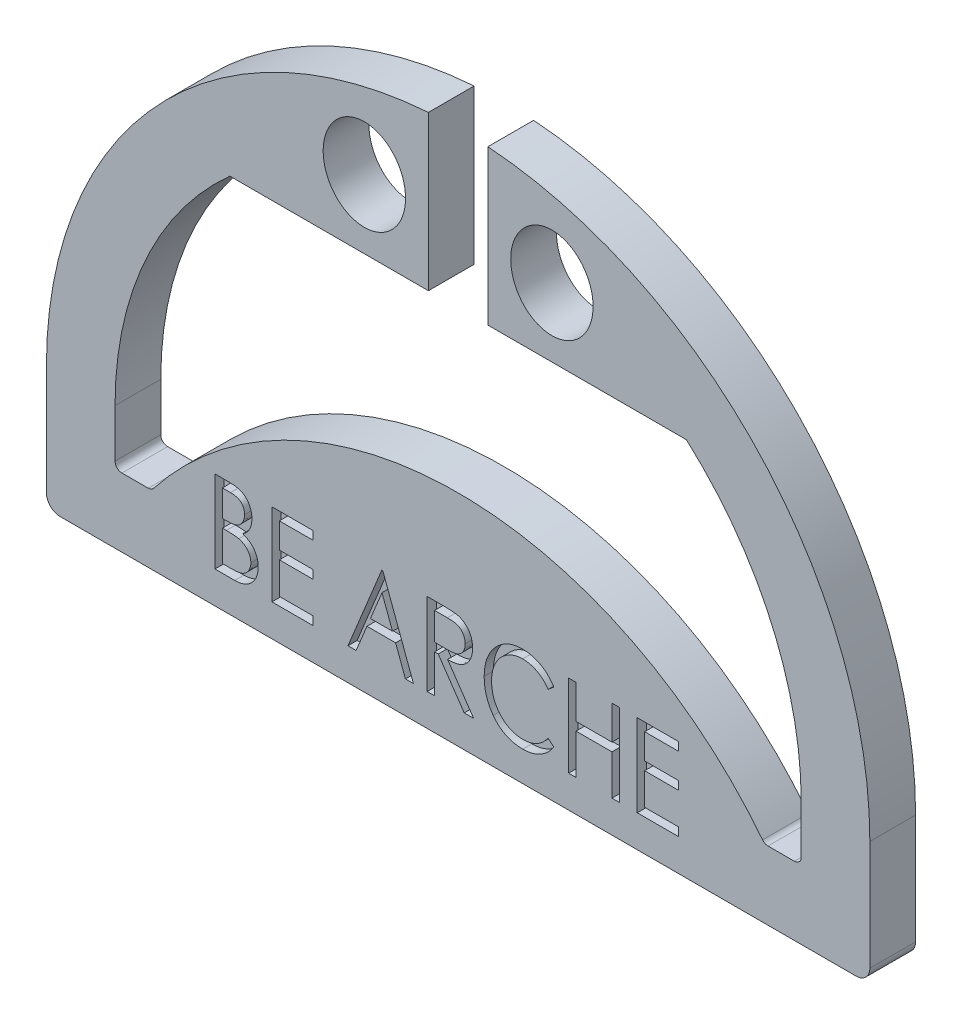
from build123d import *

# Parameters (mm, degrees)
ESQUISSE1_RX            = 10
ESQUISSE1_RY            = 9
EXTRUSION1_DEPTH        = 10
ENL_V_MAT_EXTRU_1_DEPTH = 2


with BuildPart() as part:
    # Esquisse1 → Extrusion1 (new body)
    with BuildSketch(Plane.XY):
        with BuildLine():
            Line((67.734776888, -12), (73.5, -12))
            ThreePointArc((73.5, -12), (74.560660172, -11.560660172), (75, -10.5))
            Line((75, -10.5), (75, 0))
            ThreePointArc((75, 0), (68.435155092, 30.685982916), (49.889878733, 56))
            Line((49.889878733, 56), (6.5, 56))
            Line((6.5, 56), (6.5, 89.764970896))
            ThreePointArc((6.5, 89.764970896), (65.897647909, 61.298450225), (90, 0))
            Line((90, 0), (90, -24))
            ThreePointArc((90, -24), (89.121320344, -26.121320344), (87, -27))
            Line((87, -27), (-87, -27))
            ThreePointArc((-87, -27), (-89.121320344, -26.121320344), (-90, -24))
            Line((-90, -24), (-90, 0))
            ThreePointArc((-90, 0), (-65.897647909, 61.298450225), (-6.5, 89.764970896))
            Line((-6.5, 89.764970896), (-6.5, 56))
            Line((-6.5, 56), (-49.889878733, 56))
            ThreePointArc((-49.889878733, 56), (-68.435155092, 30.685982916), (-75, 0))
            Line((-75, 0), (-75, -10.5))
            ThreePointArc((-75, -10.5), (-74.560660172, -11.560660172), (-73.5, -12))
            Line((-73.5, -12), (-67.734776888, -12))
            ThreePointArc((-67.734776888, -12), (-67.077806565, -11.848476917), (-66.553564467, -11.424519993))
            ThreePointArc((-66.553564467, -11.424519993), (0, 21), (66.553564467, -11.424519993))
            ThreePointArc((66.553564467, -11.424519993), (67.077806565, -11.848476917), (67.734776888, -12))
        make_face()
        with Locations(Location((20.5, 71), (0, 0, 90))):
            Ellipse(ESQUISSE1_RX, ESQUISSE1_RY, mode=Mode.SUBTRACT)
        with Locations(Location((-20.5, 71), (0, 0, 90))):
            Ellipse(ESQUISSE1_RX, ESQUISSE1_RY, mode=Mode.SUBTRACT)
    extrude(amount=EXTRUSION1_DEPTH)

    # Esquisse2 → Enl_v. mat.-Extru.1 (cut)
    # profile 1 of 7: a face of its own
    with BuildSketch(Plane.XY.offset(10)):
        with BuildLine():
            Line((-53.153846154, -2), (-50.081730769, -2))
            add(Edge.make_bspline(
                [(-50.081730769, -2), (-49.931443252, -2.000935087), (-49.639053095, -2.002754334), (-49.214545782, -2.029659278), (-48.817101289, -2.06692172), (-48.447847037, -2.125602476), (-48.104742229, -2.19729799), (-47.786943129, -2.281908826), (-47.496119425, -2.386752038), (-47.147614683, -2.549501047), (-46.750410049, -2.796641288), (-46.319982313, -3.156463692), (-45.952823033, -3.595272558), (-45.640064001, -4.093212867), (-45.38985026, -4.637776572), (-45.207297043, -5.218926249), (-45.097120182, -5.829946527), (-45.083715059, -6.248345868), (-45.076923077, -6.460336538)],
                knots=[0, 0, 0, 0, 0.943162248, 1.8349585, 2.668974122, 3.447905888, 4.180328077, 4.868477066, 5.51045498, 6.117996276, 7.27997042, 8.436248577, 9.624427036, 10.855171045, 12.117669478, 13.375131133, 14.670055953, 16, 16, 16, 16], degree=3))
            add(Edge.make_bspline(
                [(-45.076923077, -6.460336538), (-45.083220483, -6.659020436), (-45.095582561, -7.049045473), (-45.191335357, -7.620742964), (-45.350694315, -8.163908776), (-45.569583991, -8.677565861), (-45.8524541, -9.153684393), (-46.196667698, -9.584496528), (-46.601629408, -9.970247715), (-46.91028721, -10.181960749), (-47.067307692, -10.289663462)],
                knots=[0, 0, 0, 0, 1.056727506, 2.074401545, 3.074053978, 4.06237172, 5.037358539, 6.011107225, 6.988209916, 8, 8, 8, 8], degree=3))
            add(Edge.make_bspline(
                [(-47.067307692, -10.289663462), (-46.868823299, -10.368238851), (-46.488341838, -10.518862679), (-45.964519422, -10.784664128), (-45.512239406, -11.072763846), (-45.12968106, -11.388010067), (-44.805521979, -11.730739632), (-44.514608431, -12.096518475), (-44.273086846, -12.502995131), (-44.061125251, -12.935691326), (-43.897754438, -13.395712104), (-43.775674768, -13.876902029), (-43.708657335, -14.377916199), (-43.697794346, -14.718568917), (-43.692307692, -14.890625)],
                knots=[0, 0, 0, 0, 1.253473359, 2.402825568, 3.44468963, 4.397487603, 5.306318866, 6.211633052, 7.136718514, 8.0777245, 9.038026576, 9.998665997, 10.989170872, 12, 12, 12, 12], degree=3))
            add(Edge.make_bspline(
                [(-43.692307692, -14.890625), (-43.696311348, -15.066310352), (-43.704182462, -15.411704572), (-43.770791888, -15.91869042), (-43.87864957, -16.403998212), (-44.029961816, -16.869992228), (-44.231604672, -17.313256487), (-44.466664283, -17.742195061), (-44.757233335, -18.142038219), (-45.077062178, -18.523832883), (-45.438135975, -18.869899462), (-45.830641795, -19.174808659), (-46.257451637, -19.427406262), (-46.710666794, -19.639161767), (-47.196078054, -19.801015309), (-47.711042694, -19.914239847), (-48.253748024, -19.99035331), (-48.62593237, -19.996737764), (-48.816105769, -20)],
                knots=[0, 0, 0, 0, 1.038509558, 2.041690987, 3.017614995, 3.975041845, 4.932626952, 5.89352943, 6.861815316, 7.850082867, 8.835279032, 9.81329694, 10.782286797, 11.761646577, 12.766261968, 13.800775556, 14.87627195, 16, 16, 16, 16], degree=3))
            Line((-48.816105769, -20), (-53.153846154, -20))
            Line((-53.153846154, -20), (-53.153846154, -2))
        make_face()
        with BuildLine():
            Line((-51.538461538, -3.846153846), (-51.538461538, -9.615384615))
            Line((-51.538461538, -9.615384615), (-50.662259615, -9.615384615))
            add(Edge.make_bspline(
                [(-50.662259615, -9.615384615), (-50.53365546, -9.613356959), (-50.285986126, -9.609452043), (-49.926120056, -9.597697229), (-49.593352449, -9.566501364), (-49.28585898, -9.533801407), (-49.006698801, -9.482578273), (-48.754512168, -9.420482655), (-48.524887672, -9.354918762), (-48.25900192, -9.243424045), (-47.955900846, -9.079064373), (-47.640287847, -8.820081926), (-47.358522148, -8.51868643), (-47.122546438, -8.168432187), (-46.932418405, -7.782327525), (-46.789977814, -7.372423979), (-46.709959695, -6.938178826), (-46.698274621, -6.643344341), (-46.692307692, -6.492788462)],
                knots=[0, 0, 0, 0, 1.068645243, 2.058025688, 2.990115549, 3.844744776, 4.626241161, 5.345550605, 6.002630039, 6.607150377, 7.738038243, 8.853076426, 9.983611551, 11.155164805, 12.347513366, 13.550642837, 14.749246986, 16, 16, 16, 16], degree=3))
            add(Edge.make_bspline(
                [(-46.692307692, -6.492788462), (-46.693980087, -6.392909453), (-46.697255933, -6.197268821), (-46.734666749, -5.912594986), (-46.792414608, -5.643626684), (-46.870204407, -5.39001621), (-46.975784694, -5.154745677), (-47.103541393, -4.936588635), (-47.251014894, -4.732681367), (-47.425973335, -4.547867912), (-47.625055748, -4.381387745), (-47.850293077, -4.234598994), (-48.106001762, -4.118711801), (-48.384348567, -4.014544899), (-48.693819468, -3.942646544), (-49.028081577, -3.883221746), (-49.390046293, -3.852242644), (-49.639375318, -3.848226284), (-49.768028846, -3.846153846)],
                knots=[0, 0, 0, 0, 1.033315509, 2.02403391, 2.965976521, 3.878877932, 4.764409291, 5.628620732, 6.492115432, 7.363461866, 8.255524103, 9.173498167, 10.136325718, 11.155690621, 12.24501133, 13.419065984, 14.668240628, 16, 16, 16, 16], degree=3))
            Line((-49.768028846, -3.846153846), (-51.538461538, -3.846153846))
        make_face(mode=Mode.SUBTRACT)
        with BuildLine():
            Line((-51.538461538, -11.461538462), (-51.538461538, -18.153846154))
            Line((-51.538461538, -18.153846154), (-49.594951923, -18.153846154))
            add(Edge.make_bspline(
                [(-49.594951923, -18.153846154), (-49.456723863, -18.151874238), (-49.189813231, -18.148066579), (-48.803648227, -18.135563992), (-48.444937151, -18.107494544), (-48.115882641, -18.062662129), (-47.813980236, -18.015323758), (-47.542404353, -17.94874413), (-47.298011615, -17.875740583), (-47.01271137, -17.759034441), (-46.690722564, -17.580907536), (-46.348835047, -17.308259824), (-46.041377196, -16.989673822), (-45.7858819, -16.616786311), (-45.573098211, -16.214638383), (-45.421612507, -15.787023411), (-45.322050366, -15.344733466), (-45.312497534, -15.042601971), (-45.307692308, -14.890625)],
                knots=[0, 0, 0, 0, 1.081619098, 2.088545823, 3.022572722, 3.895065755, 4.686620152, 5.411945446, 6.081214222, 6.68019563, 7.821024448, 8.946046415, 10.090087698, 11.271885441, 12.47066001, 13.639667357, 14.812714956, 16, 16, 16, 16], degree=3))
            add(Edge.make_bspline(
                [(-45.307692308, -14.890625), (-45.315277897, -14.702262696), (-45.330165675, -14.332575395), (-45.469366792, -13.799312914), (-45.691673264, -13.302846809), (-46.005215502, -12.852748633), (-46.390412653, -12.450833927), (-46.849233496, -12.115269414), (-47.374253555, -11.847937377), (-47.757387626, -11.733237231), (-47.954326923, -11.674278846)],
                knots=[0, 0, 0, 0, 1.002523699, 1.967592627, 2.916812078, 3.889001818, 4.876880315, 5.871365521, 6.905835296, 8, 8, 8, 8], degree=3))
            add(Edge.make_bspline(
                [(-47.954326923, -11.674278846), (-48.025046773, -11.656550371), (-48.177446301, -11.618345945), (-48.428234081, -11.576879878), (-48.714561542, -11.54136172), (-49.037055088, -11.514310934), (-49.393838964, -11.486655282), (-49.788432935, -11.475708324), (-50.218670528, -11.462994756), (-50.518015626, -11.462035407), (-50.673076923, -11.461538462)],
                knots=[0, 0, 0, 0, 0.639967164, 1.379113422, 2.229991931, 3.173071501, 4.220511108, 5.371654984, 6.638512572, 8, 8, 8, 8], degree=3))
            Line((-50.673076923, -11.461538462), (-51.538461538, -11.461538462))
        make_face(mode=Mode.SUBTRACT)
    # profile 2 of 7: a face of its own
    with BuildSketch(Plane.XY.offset(10)):
        Polygon((-40.692307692, -2), (-31.692307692, -2), (-31.692307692, -3.846153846), (-39.076923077, -3.846153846), (-39.076923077, -9.384615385), (-31.692307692, -9.384615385), (-31.692307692, -11.230769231), (-39.076923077, -11.230769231), (-39.076923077, -18.153846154), (-31.692307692, -18.153846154), (-31.692307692, -20), (-40.692307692, -20), align=None)
    # profile 3 of 7: a face of its own
    with BuildSketch(Plane.XY.offset(10)):
        Polygon((-16.461538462, -2), (-9.769230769, -20), (-11.521634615, -20), (-13.663461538, -14.230769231), (-19.930288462, -14.230769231), (-22.295673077, -20), (-24.076923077, -20), (-16.692307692, -2), align=None)
        Polygon((-16.641826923, -6.222355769), (-19.169471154, -12.384615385), (-14.352163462, -12.384615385), align=None, mode=Mode.SUBTRACT)
    # profile 4 of 7: a face of its own
    with BuildSketch(Plane.XY.offset(10)):
        with BuildLine():
            Line((-6.769230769, -2), (-3.610576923, -2))
            add(Edge.make_bspline(
                [(-3.610576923, -2), (-3.399040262, -2.000791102), (-2.993965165, -2.002305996), (-2.413237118, -2.010956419), (-1.885749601, -2.035474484), (-1.410483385, -2.056555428), (-0.98885838, -2.095223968), (-0.62025438, -2.131527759), (-0.304757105, -2.181013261), (-0.113986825, -2.225004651), (-0.026442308, -2.245192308)],
                knots=[0, 0, 0, 0, 1.410548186, 2.701082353, 3.872164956, 4.931545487, 5.872643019, 6.694846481, 7.4010648, 8, 8, 8, 8], degree=3))
            add(Edge.make_bspline(
                [(-0.026442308, -2.245192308), (0.088487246, -2.27783198), (0.317081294, -2.34275205), (0.645244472, -2.478989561), (0.959441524, -2.636725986), (1.257425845, -2.821137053), (1.535216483, -3.03505799), (1.795775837, -3.275049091), (2.042808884, -3.539394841), (2.270409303, -3.829821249), (2.48223039, -4.139339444), (2.661105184, -4.471390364), (2.81269805, -4.820385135), (2.94169863, -5.18447817), (3.030752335, -5.568741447), (3.107491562, -5.967317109), (3.144337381, -6.385123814), (3.150645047, -6.66942208), (3.153846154, -6.813701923)],
                knots=[0, 0, 0, 0, 0.953385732, 1.896277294, 2.832058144, 3.758936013, 4.690028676, 5.627530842, 6.585110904, 7.575978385, 8.571622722, 9.576661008, 10.582432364, 11.608427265, 12.656015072, 13.729146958, 14.84755428, 16, 16, 16, 16], degree=3))
            add(Edge.make_bspline(
                [(3.153846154, -6.813701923), (3.146018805, -7.053310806), (3.130785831, -7.519618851), (3.018383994, -8.197490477), (2.82635745, -8.830096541), (2.560089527, -9.415043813), (2.224891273, -9.944814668), (1.820409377, -10.410394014), (1.345669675, -10.800741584), (0.90228641, -11.072641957), (0.510107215, -11.246715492), (0.188737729, -11.368396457), (-0.162524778, -11.461957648), (-0.538578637, -11.546698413), (-0.942158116, -11.610105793), (-1.372918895, -11.656711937), (-1.830138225, -11.685678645), (-2.144187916, -11.690060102), (-2.305288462, -11.692307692)],
                knots=[0, 0, 0, 0, 1.376286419, 2.678420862, 3.934476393, 5.16434824, 6.359712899, 7.524467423, 8.691553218, 9.878209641, 10.499433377, 11.154907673, 11.850203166, 12.585724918, 13.369062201, 14.195702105, 15.074435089, 16, 16, 16, 16], degree=3))
            Line((-2.305288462, -11.692307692), (3.384615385, -20))
            Line((3.384615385, -20), (1.336538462, -20))
            Line((1.336538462, -20), (-4.353365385, -11.692307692))
            Line((-4.353365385, -11.692307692), (-5.153846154, -11.692307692))
            Line((-5.153846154, -11.692307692), (-5.153846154, -20))
            Line((-5.153846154, -20), (-6.769230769, -20))
            Line((-6.769230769, -20), (-6.769230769, -2))
        make_face()
        with BuildLine():
            Line((-5.153846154, -3.846153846), (-5.153846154, -9.846153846))
            Line((-5.153846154, -9.846153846), (-2.424278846, -9.871394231))
            add(Edge.make_bspline(
                [(-2.424278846, -9.871394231), (-2.296841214, -9.871446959), (-2.049034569, -9.871549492), (-1.690861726, -9.85109509), (-1.357528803, -9.82778989), (-1.050728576, -9.791699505), (-0.770033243, -9.746132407), (-0.51492186, -9.687677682), (-0.285214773, -9.621330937), (-0.015730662, -9.515358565), (0.286177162, -9.350563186), (0.613964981, -9.109459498), (0.888378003, -8.8065327), (1.123790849, -8.463783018), (1.308579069, -8.083915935), (1.444111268, -7.678135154), (1.52508541, -7.250835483), (1.533964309, -6.958278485), (1.538461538, -6.810096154)],
                knots=[0, 0, 0, 0, 1.065336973, 2.071582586, 2.998846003, 3.85897903, 4.653684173, 5.375320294, 6.046259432, 6.650926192, 7.793083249, 8.91264409, 10.036257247, 11.193087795, 12.379657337, 13.555538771, 14.761861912, 16, 16, 16, 16], degree=3))
            add(Edge.make_bspline(
                [(1.538461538, -6.810096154), (1.534448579, -6.665396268), (1.52652036, -6.379519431), (1.438245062, -5.963232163), (1.307445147, -5.564273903), (1.112841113, -5.197051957), (0.888151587, -4.857491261), (0.616945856, -4.569902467), (0.315011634, -4.330766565), (0.029990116, -4.177303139), (-0.22468329, -4.082696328), (-0.443826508, -4.018318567), (-0.691966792, -3.963919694), (-0.9692963, -3.922967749), (-1.275753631, -3.885941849), (-1.611448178, -3.861805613), (-1.975826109, -3.847193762), (-2.228349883, -3.846509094), (-2.359375, -3.846153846)],
                knots=[0, 0, 0, 0, 1.234327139, 2.438602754, 3.620607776, 4.81008266, 5.97781748, 7.089343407, 8.171889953, 9.256139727, 9.837835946, 10.490922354, 11.205974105, 12.006200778, 12.885051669, 13.842733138, 14.880675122, 16, 16, 16, 16], degree=3))
            Line((-2.359375, -3.846153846), (-5.153846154, -3.846153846))
        make_face(mode=Mode.SUBTRACT)
    # profile 5 of 7: a face of its own
    with BuildSketch(Plane.XY.offset(10)):
        with BuildLine():
            Line((20.923076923, -5.302884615), (19.679086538, -6.384615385))
            add(Edge.make_bspline(
                [(19.679086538, -6.384615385), (19.506335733, -6.149683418), (19.16727417, -5.688577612), (18.578881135, -5.078613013), (17.935044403, -4.562528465), (17.244243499, -4.136297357), (16.51287581, -3.796711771), (15.741269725, -3.559935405), (14.934960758, -3.409366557), (14.384087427, -3.392946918), (14.104567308, -3.384615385)],
                knots=[0, 0, 0, 0, 1.060001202, 2.080486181, 3.072710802, 4.054397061, 5.026768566, 5.997634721, 6.983974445, 8, 8, 8, 8], degree=3))
            add(Edge.make_bspline(
                [(14.104567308, -3.384615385), (13.950557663, -3.38668599), (13.644086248, -3.390806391), (13.189063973, -3.445547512), (12.74161393, -3.522701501), (12.303821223, -3.634649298), (11.876427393, -3.782121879), (11.453327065, -3.952016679), (11.043420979, -4.1639802), (10.642624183, -4.400875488), (10.259074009, -4.667047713), (9.894154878, -4.956043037), (9.550542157, -5.265390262), (9.232923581, -5.600504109), (8.932551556, -5.952169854), (8.657278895, -6.329902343), (8.406620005, -6.729905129), (8.17493603, -7.147990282), (7.969504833, -7.583745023), (7.793198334, -8.034514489), (7.644480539, -8.499551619), (7.523207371, -8.977850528), (7.424754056, -9.468606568), (7.356227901, -9.973147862), (7.31683986, -10.490950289), (7.310759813, -10.841280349), (7.307692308, -11.018028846)],
                knots=[0, 0, 0, 0, 0.972857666, 1.935937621, 2.892644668, 3.84153827, 4.78805697, 5.748767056, 6.720437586, 7.701476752, 8.689783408, 9.668584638, 10.642064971, 11.609211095, 12.58482327, 13.563359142, 14.560270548, 15.566717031, 16.582807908, 17.60275364, 18.623802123, 19.666660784, 20.719981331, 21.78574766, 22.882865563, 24, 24, 24, 24], degree=3))
            add(Edge.make_bspline(
                [(7.307692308, -11.018028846), (7.312245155, -11.283986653), (7.321174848, -11.80562102), (7.420568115, -12.56971675), (7.567121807, -13.301402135), (7.788216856, -13.997345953), (8.05981875, -14.663212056), (8.398437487, -15.294117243), (8.795888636, -15.891369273), (9.2523252, -16.447184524), (9.754349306, -16.95323883), (10.291486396, -17.400774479), (10.866726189, -17.773842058), (11.470466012, -18.082046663), (12.107468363, -18.323213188), (12.7769817, -18.489203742), (13.477107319, -18.599778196), (13.955093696, -18.610121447), (14.198317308, -18.615384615)],
                knots=[0, 0, 0, 0, 1.112867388, 2.18271418, 3.220979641, 4.233260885, 5.235081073, 6.227925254, 7.225857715, 8.234253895, 9.234163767, 10.206453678, 11.155586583, 12.098576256, 13.039778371, 14.000328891, 14.982466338, 16, 16, 16, 16], degree=3))
            add(Edge.make_bspline(
                [(14.198317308, -18.615384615), (14.46575367, -18.606536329), (14.994787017, -18.589032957), (15.769538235, -18.444946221), (16.51052343, -18.207818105), (17.21778427, -17.878317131), (17.889870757, -17.449580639), (18.529993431, -16.932417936), (19.133276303, -16.316509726), (19.49368122, -15.85354857), (19.679086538, -15.615384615)],
                knots=[0, 0, 0, 0, 0.986957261, 1.952364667, 2.898367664, 3.853405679, 4.824884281, 5.834775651, 6.886130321, 8, 8, 8, 8], degree=3))
            Line((19.679086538, -15.615384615), (20.923076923, -16.686298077))
            add(Edge.make_bspline(
                [(20.923076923, -16.686298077), (20.825074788, -16.832980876), (20.629948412, -17.125032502), (20.309091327, -17.536723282), (19.972846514, -17.925065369), (19.617536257, -18.287459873), (19.244439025, -18.624795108), (18.85269067, -18.937957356), (18.441495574, -19.220820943), (18.01575772, -19.482611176), (17.573436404, -19.712522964), (17.117433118, -19.910791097), (16.650409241, -20.081208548), (16.170253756, -20.222619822), (15.676138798, -20.330610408), (15.168833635, -20.404997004), (14.65002073, -20.454407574), (14.299393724, -20.459148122), (14.122596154, -20.461538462)],
                knots=[0, 0, 0, 0, 1.041298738, 2.073269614, 3.079343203, 4.072975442, 5.067823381, 6.04757226, 7.031859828, 8.012841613, 8.996822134, 9.972475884, 10.946812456, 11.930409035, 12.925687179, 13.930333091, 14.956406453, 16, 16, 16, 16], degree=3))
            add(Edge.make_bspline(
                [(14.122596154, -20.461538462), (13.954226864, -20.460205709), (13.621802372, -20.457574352), (13.131088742, -20.414298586), (12.652876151, -20.355207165), (12.188806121, -20.266968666), (11.735861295, -20.161768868), (11.299319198, -20.021163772), (10.873807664, -19.865629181), (10.464092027, -19.679005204), (10.06719908, -19.470818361), (9.68370566, -19.23479983), (9.313290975, -18.975429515), (8.954624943, -18.693798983), (8.611664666, -18.386403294), (8.28318199, -18.05389424), (7.968273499, -17.695833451), (7.771522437, -17.442172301), (7.671875, -17.313701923)],
                knots=[0, 0, 0, 0, 1.082168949, 2.13660973, 3.165131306, 4.179150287, 5.172582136, 6.152699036, 7.125936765, 8.084022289, 9.045033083, 10.005950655, 10.977130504, 11.951134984, 12.93626608, 13.936288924, 14.954803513, 16, 16, 16, 16], degree=3))
            add(Edge.make_bspline(
                [(7.671875, -17.313701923), (7.512238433, -17.089467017), (7.19363743, -16.64194132), (6.797795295, -15.917820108), (6.450354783, -15.166968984), (6.174611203, -14.377581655), (5.957244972, -13.555454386), (5.802548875, -12.699530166), (5.712077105, -11.808443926), (5.698974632, -11.203332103), (5.692307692, -10.895432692)],
                knots=[0, 0, 0, 0, 0.965695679, 1.927325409, 2.892347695, 3.868051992, 4.858934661, 5.8754491, 6.918963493, 8, 8, 8, 8], degree=3))
            add(Edge.make_bspline(
                [(5.692307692, -10.895432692), (5.698313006, -10.571739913), (5.710118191, -9.935427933), (5.830530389, -9.002019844), (6.016858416, -8.108104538), (6.27489089, -7.251497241), (6.618312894, -6.437528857), (7.027822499, -5.658724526), (7.520122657, -4.922964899), (8.07808723, -4.231850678), (8.69258014, -3.601414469), (9.351459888, -3.047322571), (10.05289256, -2.584753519), (10.78688769, -2.198521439), (11.561274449, -1.900363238), (12.374631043, -1.692861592), (13.22540069, -1.56302429), (13.806021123, -1.546735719), (14.100961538, -1.538461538)],
                knots=[0, 0, 0, 0, 1.106112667, 2.174385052, 3.211582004, 4.225457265, 5.227447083, 6.227412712, 7.229175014, 8.248903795, 9.260110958, 10.234480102, 11.186099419, 12.127120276, 13.064977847, 14.015771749, 14.992062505, 16, 16, 16, 16], degree=3))
            add(Edge.make_bspline(
                [(14.100961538, -1.538461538), (14.280147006, -1.540955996), (14.635541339, -1.545903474), (15.161943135, -1.593824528), (15.675840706, -1.673838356), (16.176711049, -1.782016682), (16.666049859, -1.917112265), (17.138155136, -2.092394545), (17.597836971, -2.295225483), (18.044579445, -2.52447024), (18.473299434, -2.785473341), (18.885297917, -3.069116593), (19.274121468, -3.381732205), (19.648819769, -3.712384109), (19.99649437, -4.074231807), (20.327566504, -4.458508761), (20.636813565, -4.869084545), (20.827219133, -5.157622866), (20.923076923, -5.302884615)],
                knots=[0, 0, 0, 0, 1.05516527, 2.092802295, 3.110026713, 4.116678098, 5.109494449, 6.097148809, 7.079716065, 8.067547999, 9.05215325, 10.03400621, 11.011331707, 11.988990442, 12.975223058, 13.964195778, 14.975094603, 16, 16, 16, 16], degree=3))
        make_face()
    # profile 6 of 7: a face of its own
    with BuildSketch(Plane.XY.offset(10)):
        Polygon((24.153846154, -2), (25.769230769, -2), (25.769230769, -9.384615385), (33.615384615, -9.384615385), (33.615384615, -2), (35.230769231, -2), (35.230769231, -20), (33.615384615, -20), (33.615384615, -11.230769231), (25.769230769, -11.230769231), (25.769230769, -20), (24.153846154, -20), align=None)
    # profile 7 of 7: a face of its own
    with BuildSketch(Plane.XY.offset(10)):
        Polygon((39.153846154, -2), (48.153846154, -2), (48.153846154, -3.846153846), (40.769230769, -3.846153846), (40.769230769, -9.384615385), (48.153846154, -9.384615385), (48.153846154, -11.230769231), (40.769230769, -11.230769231), (40.769230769, -18.153846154), (48.153846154, -18.153846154), (48.153846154, -20), (39.153846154, -20), align=None)
    extrude(amount=-ENL_V_MAT_EXTRU_1_DEPTH, mode=Mode.SUBTRACT)


solid = part.part
